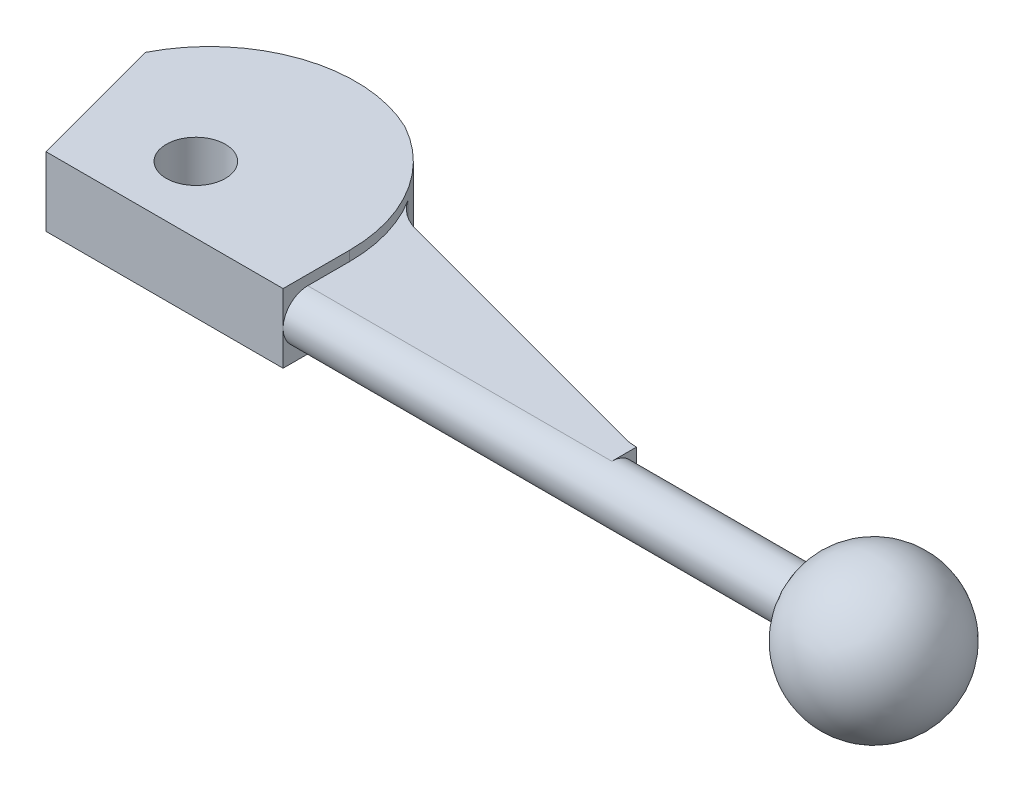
ISO-10303-21;
HEADER;
FILE_DESCRIPTION(('STEP AP214'),'2;1');
FILE_NAME('part.step','',(''),(''),'','','');
FILE_SCHEMA(('AUTOMOTIVE_DESIGN { 1 0 10303 214 1 1 1 1 }'));
ENDSEC;
DATA;
#1=APPLICATION_CONTEXT('core data for automotive mechanical design processes');
#2=APPLICATION_PROTOCOL_DEFINITION('international standard','automotive_design',2000,#1);
#3=PRODUCT_CONTEXT('',#1,'mechanical');
#4=PRODUCT('Part','Part','',(#3));
#5=PRODUCT_RELATED_PRODUCT_CATEGORY('part','',(#4));
#6=PRODUCT_DEFINITION_FORMATION('','',#4);
#7=PRODUCT_DEFINITION_CONTEXT('part definition',#1,'design');
#8=PRODUCT_DEFINITION('design','',#6,#7);
#9=PRODUCT_DEFINITION_SHAPE('','',#8);
#10=(LENGTH_UNIT() NAMED_UNIT(*) SI_UNIT(.MILLI.,.METRE.));
#11=(NAMED_UNIT(*) PLANE_ANGLE_UNIT() SI_UNIT($,.RADIAN.));
#12=(NAMED_UNIT(*) SI_UNIT($,.STERADIAN.) SOLID_ANGLE_UNIT());
#13=UNCERTAINTY_MEASURE_WITH_UNIT(LENGTH_MEASURE(1.E-05),#10,'distance_accuracy_value','');
#14=(GEOMETRIC_REPRESENTATION_CONTEXT(3) GLOBAL_UNCERTAINTY_ASSIGNED_CONTEXT((#13)) GLOBAL_UNIT_ASSIGNED_CONTEXT((#10,
#11,#12)) REPRESENTATION_CONTEXT('',''));
#15=CARTESIAN_POINT('',(0.,0.,0.));
#16=DIRECTION('',(0.,0.,1.));
#17=DIRECTION('',(1.,0.,0.));
#18=AXIS2_PLACEMENT_3D('',#15,#16,#17);
#19=CARTESIAN_POINT('',(0.,-7.,0.));
#20=DIRECTION('',(0.,-1.,0.));
#21=DIRECTION('',(1.,0.,0.));
#22=AXIS2_PLACEMENT_3D('',#19,#20,#21);
#23=CYLINDRICAL_SURFACE('',#22,6.);
#24=CARTESIAN_POINT('',(0.,7.,0.));
#25=DIRECTION('',(0.,-1.,0.));
#26=DIRECTION('',(1.,0.,0.));
#27=AXIS2_PLACEMENT_3D('',#24,#25,#26);
#28=CIRCLE('',#27,6.);
#29=CARTESIAN_POINT('',(6.,7.,0.));
#30=VERTEX_POINT('',#29);
#31=EDGE_CURVE('E222',#30,#30,#28,.F.);
#32=ORIENTED_EDGE('',*,*,#31,.T.);
#33=EDGE_LOOP('',(#32));
#34=FACE_BOUND('',#33,.T.);
#35=CARTESIAN_POINT('',(0.,-7.,0.));
#36=DIRECTION('',(0.,-1.,0.));
#37=DIRECTION('',(1.,0.,0.));
#38=AXIS2_PLACEMENT_3D('',#35,#36,#37);
#39=CIRCLE('',#38,6.);
#40=CARTESIAN_POINT('',(6.,-7.,0.));
#41=VERTEX_POINT('',#40);
#42=EDGE_CURVE('E17',#41,#41,#39,.F.);
#43=ORIENTED_EDGE('',*,*,#42,.F.);
#44=EDGE_LOOP('',(#43));
#45=FACE_BOUND('',#44,.T.);
#46=ADVANCED_FACE('F14',(#34,#45),#23,.F.);
#47=CARTESIAN_POINT('',(2.2,-7.,-0.550000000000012));
#48=DIRECTION('',(0.,-1.,0.));
#49=DIRECTION('',(1.,0.,0.));
#50=AXIS2_PLACEMENT_3D('',#47,#48,#49);
#51=CYLINDRICAL_SURFACE('',#50,29.7);
#52=CARTESIAN_POINT('',(2.2,-7.,-0.550000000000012));
#53=DIRECTION('',(0.,-1.,0.));
#54=DIRECTION('',(1.,0.,0.));
#55=AXIS2_PLACEMENT_3D('',#52,#53,#54);
#56=CIRCLE('',#55,29.7);
#57=CARTESIAN_POINT('',(-24.27,-7.,-14.0195619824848));
#58=VERTEX_POINT('',#57);
#59=CARTESIAN_POINT('',(15.105190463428,-7.,-27.2996926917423));
#60=VERTEX_POINT('',#59);
#61=EDGE_CURVE('E126',#58,#60,#56,.T.);
#62=ORIENTED_EDGE('',*,*,#61,.F.);
#63=DIRECTION('',(0.,-1.,0.));
#64=VECTOR('',#63,1.);
#65=CARTESIAN_POINT('',(-24.27,-7.,-14.0195619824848));
#66=LINE('',#65,#64);
#67=CARTESIAN_POINT('',(-24.27,7.,-14.0195619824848));
#68=VERTEX_POINT('',#67);
#69=EDGE_CURVE('E113',#58,#68,#66,.F.);
#70=ORIENTED_EDGE('',*,*,#69,.T.);
#71=CARTESIAN_POINT('',(2.2,7.,-0.550000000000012));
#72=DIRECTION('',(0.,-1.,0.));
#73=DIRECTION('',(1.,0.,0.));
#74=AXIS2_PLACEMENT_3D('',#71,#72,#73);
#75=CIRCLE('',#74,29.7);
#76=CARTESIAN_POINT('',(15.105190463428,7.,-27.2996926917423));
#77=VERTEX_POINT('',#76);
#78=EDGE_CURVE('E218',#68,#77,#75,.T.);
#79=ORIENTED_EDGE('',*,*,#78,.T.);
#80=DIRECTION('',(0.,-1.,0.));
#81=VECTOR('',#80,1.);
#82=CARTESIAN_POINT('',(15.1051904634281,-7.,-27.2996926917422));
#83=LINE('',#82,#81);
#84=EDGE_CURVE('E129',#60,#77,#83,.F.);
#85=ORIENTED_EDGE('',*,*,#84,.F.);
#86=EDGE_LOOP('',(#62,#70,#79,#85));
#87=FACE_BOUND('',#86,.T.);
#88=ADVANCED_FACE('F127',(#87),#51,.T.);
#89=CARTESIAN_POINT('',(-16.896155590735,-7.,13.5));
#90=DIRECTION('',(0.965925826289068,0.,-0.258819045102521));
#91=DIRECTION('',(0.258819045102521,0.,0.965925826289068));
#92=AXIS2_PLACEMENT_3D('',#89,#90,#91);
#93=PLANE('',#92);
#94=ORIENTED_EDGE('',*,*,#69,.F.);
#95=DIRECTION('',(-0.25881904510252,0.,-0.965925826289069));
#96=VECTOR('',#95,1.);
#97=CARTESIAN_POINT('',(-16.896155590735,-7.,13.5));
#98=LINE('',#97,#96);
#99=CARTESIAN_POINT('',(-16.896155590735,-7.,13.5));
#100=VERTEX_POINT('',#99);
#101=EDGE_CURVE('E117',#100,#58,#98,.T.);
#102=ORIENTED_EDGE('',*,*,#101,.F.);
#103=DIRECTION('',(0.,-1.,0.));
#104=VECTOR('',#103,1.);
#105=CARTESIAN_POINT('',(-16.896155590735,-7.,13.5));
#106=LINE('',#105,#104);
#107=CARTESIAN_POINT('',(-16.896155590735,7.,13.5));
#108=VERTEX_POINT('',#107);
#109=EDGE_CURVE('E144',#100,#108,#106,.F.);
#110=ORIENTED_EDGE('',*,*,#109,.T.);
#111=DIRECTION('',(-0.25881904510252,0.,-0.965925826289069));
#112=VECTOR('',#111,1.);
#113=CARTESIAN_POINT('',(-16.896155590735,7.,13.5));
#114=LINE('',#113,#112);
#115=EDGE_CURVE('E120',#108,#68,#114,.T.);
#116=ORIENTED_EDGE('',*,*,#115,.T.);
#117=EDGE_LOOP('',(#94,#102,#110,#116));
#118=FACE_BOUND('',#117,.T.);
#119=ADVANCED_FACE('F115',(#118),#93,.F.);
#120=CARTESIAN_POINT('',(2.2,-7.,-0.550000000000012));
#121=DIRECTION('',(0.,-1.,0.));
#122=DIRECTION('',(1.,0.,0.));
#123=AXIS2_PLACEMENT_3D('',#120,#121,#122);
#124=PLANE('',#123);
#125=DIRECTION('',(0.,0.,-1.));
#126=VECTOR('',#125,1.);
#127=CARTESIAN_POINT('',(31.2,-7.,0.));
#128=LINE('',#127,#126);
#129=CARTESIAN_POINT('',(31.2,-7.,0.));
#130=VERTEX_POINT('',#129);
#131=CARTESIAN_POINT('',(31.2,-7.,13.5));
#132=VERTEX_POINT('',#131);
#133=EDGE_CURVE('E142',#130,#132,#128,.F.);
#134=ORIENTED_EDGE('',*,*,#133,.T.);
#135=DIRECTION('',(1.,0.,0.));
#136=VECTOR('',#135,1.);
#137=CARTESIAN_POINT('',(31.2,-7.,13.5));
#138=LINE('',#137,#136);
#139=EDGE_CURVE('E136',#132,#100,#138,.F.);
#140=ORIENTED_EDGE('',*,*,#139,.T.);
#141=ORIENTED_EDGE('',*,*,#101,.T.);
#142=ORIENTED_EDGE('',*,*,#61,.T.);
#143=CARTESIAN_POINT('',(0.,-7.,0.));
#144=DIRECTION('',(0.,-1.,0.));
#145=DIRECTION('',(1.,0.,0.));
#146=AXIS2_PLACEMENT_3D('',#143,#144,#145);
#147=CIRCLE('',#146,31.2);
#148=EDGE_CURVE('E148',#130,#60,#147,.F.);
#149=ORIENTED_EDGE('',*,*,#148,.F.);
#150=EDGE_LOOP('',(#134,#140,#141,#142,#149));
#151=FACE_BOUND('',#150,.T.);
#152=ORIENTED_EDGE('',*,*,#42,.T.);
#153=EDGE_LOOP('',(#152));
#154=FACE_BOUND('',#153,.T.);
#155=ADVANCED_FACE('F133',(#151,#154),#124,.T.);
#156=CARTESIAN_POINT('',(92.816524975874,-5.,3.5));
#157=DIRECTION('',(0.,0.,1.));
#158=DIRECTION('',(0.,-1.,0.));
#159=AXIS2_PLACEMENT_3D('',#156,#157,#158);
#160=PLANE('',#159);
#161=DIRECTION('',(1.,0.,0.));
#162=VECTOR('',#161,1.);
#163=CARTESIAN_POINT('',(-1.14491749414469E-13,-5.,3.5));
#164=LINE('',#163,#162);
#165=CARTESIAN_POINT('',(92.816524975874,-5.,3.5));
#166=VERTEX_POINT('',#165);
#167=CARTESIAN_POINT('',(92.88,-5.,3.5));
#168=VERTEX_POINT('',#167);
#169=EDGE_CURVE('E207',#166,#168,#164,.T.);
#170=ORIENTED_EDGE('',*,*,#169,.F.);
#171=DIRECTION('',(0.,-1.,0.));
#172=VECTOR('',#171,1.);
#173=CARTESIAN_POINT('',(92.816524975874,-5.,3.5));
#174=LINE('',#173,#172);
#175=CARTESIAN_POINT('',(92.816524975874,5.,3.5));
#176=VERTEX_POINT('',#175);
#177=EDGE_CURVE('E219',#166,#176,#174,.F.);
#178=ORIENTED_EDGE('',*,*,#177,.T.);
#179=DIRECTION('',(1.,0.,0.));
#180=VECTOR('',#179,1.);
#181=CARTESIAN_POINT('',(92.816524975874,5.,3.5));
#182=LINE('',#181,#180);
#183=CARTESIAN_POINT('',(92.88,5.,3.5));
#184=VERTEX_POINT('',#183);
#185=EDGE_CURVE('E132',#184,#176,#182,.F.);
#186=ORIENTED_EDGE('',*,*,#185,.F.);
#187=DIRECTION('',(0.,1.,0.));
#188=VECTOR('',#187,1.);
#189=CARTESIAN_POINT('',(92.88,0.,3.5));
#190=LINE('',#189,#188);
#191=CARTESIAN_POINT('',(92.88,0.,3.5));
#192=VERTEX_POINT('',#191);
#193=EDGE_CURVE('E184',#192,#184,#190,.T.);
#194=ORIENTED_EDGE('',*,*,#193,.F.);
#195=DIRECTION('',(0.,1.,0.));
#196=VECTOR('',#195,1.);
#197=CARTESIAN_POINT('',(92.88,0.,3.5));
#198=LINE('',#197,#196);
#199=EDGE_CURVE('E191',#168,#192,#198,.T.);
#200=ORIENTED_EDGE('',*,*,#199,.F.);
#201=EDGE_LOOP('',(#170,#178,#186,#194,#200));
#202=FACE_BOUND('',#201,.T.);
#203=ADVANCED_FACE('F269',(#202),#160,.F.);
#204=CARTESIAN_POINT('',(34.8068652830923,-5.,-22.0436414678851));
#205=DIRECTION('',(0.,-1.,0.));
#206=DIRECTION('',(1.,0.,0.));
#207=AXIS2_PLACEMENT_3D('',#204,#205,#206);
#208=CYLINDRICAL_SURFACE('',#207,10.);
#209=DIRECTION('',(0.,-1.,0.));
#210=VECTOR('',#209,1.);
#211=CARTESIAN_POINT('',(32.2186748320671,-5.,-12.3843832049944));
#212=LINE('',#211,#210);
#213=CARTESIAN_POINT('',(32.2186748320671,5.,-12.3843832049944));
#214=VERTEX_POINT('',#213);
#215=CARTESIAN_POINT('',(32.2186748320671,-5.,-12.3843832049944));
#216=VERTEX_POINT('',#215);
#217=EDGE_CURVE('E225',#214,#216,#212,.T.);
#218=ORIENTED_EDGE('',*,*,#217,.T.);
#219=CARTESIAN_POINT('',(34.8068652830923,-5.,-22.0436414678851));
#220=DIRECTION('',(0.,-1.,0.));
#221=DIRECTION('',(1.,0.,0.));
#222=AXIS2_PLACEMENT_3D('',#219,#220,#221);
#223=CIRCLE('',#222,10.);
#224=CARTESIAN_POINT('',(26.3585970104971,-5.,-16.6932430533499));
#225=VERTEX_POINT('',#224);
#226=EDGE_CURVE('E202',#225,#216,#223,.F.);
#227=ORIENTED_EDGE('',*,*,#226,.F.);
#228=DIRECTION('',(0.,-1.,0.));
#229=VECTOR('',#228,1.);
#230=CARTESIAN_POINT('',(26.3585970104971,-7.,-16.6932430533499));
#231=LINE('',#230,#229);
#232=CARTESIAN_POINT('',(26.3585970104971,5.,-16.6932430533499));
#233=VERTEX_POINT('',#232);
#234=EDGE_CURVE('E217',#233,#225,#231,.T.);
#235=ORIENTED_EDGE('',*,*,#234,.F.);
#236=CARTESIAN_POINT('',(34.8068652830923,5.,-22.0436414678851));
#237=DIRECTION('',(0.,-1.,0.));
#238=DIRECTION('',(1.,0.,0.));
#239=AXIS2_PLACEMENT_3D('',#236,#237,#238);
#240=CIRCLE('',#239,10.);
#241=EDGE_CURVE('E180',#233,#214,#240,.F.);
#242=ORIENTED_EDGE('',*,*,#241,.T.);
#243=EDGE_LOOP('',(#218,#227,#235,#242));
#244=FACE_BOUND('',#243,.T.);
#245=ADVANCED_FACE('F265',(#244),#208,.F.);
#246=CARTESIAN_POINT('',(32.2186748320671,-5.,-12.3843832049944));
#247=DIRECTION('',(-0.258819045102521,0.,0.965925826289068));
#248=DIRECTION('',(-0.965925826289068,0.,-0.258819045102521));
#249=AXIS2_PLACEMENT_3D('',#246,#247,#248);
#250=PLANE('',#249);
#251=DIRECTION('',(0.,-1.,0.));
#252=VECTOR('',#251,1.);
#253=CARTESIAN_POINT('',(90.2283345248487,-5.,3.15925826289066));
#254=LINE('',#253,#252);
#255=CARTESIAN_POINT('',(90.2283345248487,5.,3.15925826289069));
#256=VERTEX_POINT('',#255);
#257=CARTESIAN_POINT('',(90.2283345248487,-5.,3.15925826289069));
#258=VERTEX_POINT('',#257);
#259=EDGE_CURVE('E223',#256,#258,#254,.T.);
#260=ORIENTED_EDGE('',*,*,#259,.T.);
#261=DIRECTION('',(0.965925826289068,0.,0.258819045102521));
#262=VECTOR('',#261,1.);
#263=CARTESIAN_POINT('',(32.2186748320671,-5.,-12.3843832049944));
#264=LINE('',#263,#262);
#265=EDGE_CURVE('E199',#216,#258,#264,.T.);
#266=ORIENTED_EDGE('',*,*,#265,.F.);
#267=ORIENTED_EDGE('',*,*,#217,.F.);
#268=DIRECTION('',(0.965925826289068,0.,0.258819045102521));
#269=VECTOR('',#268,1.);
#270=CARTESIAN_POINT('',(32.2186748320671,5.,-12.3843832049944));
#271=LINE('',#270,#269);
#272=EDGE_CURVE('E177',#214,#256,#271,.T.);
#273=ORIENTED_EDGE('',*,*,#272,.T.);
#274=EDGE_LOOP('',(#260,#266,#267,#273));
#275=FACE_BOUND('',#274,.T.);
#276=ADVANCED_FACE('F258',(#275),#250,.F.);
#277=CARTESIAN_POINT('',(92.816524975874,-5.,-6.5));
#278=DIRECTION('',(0.,-1.,0.));
#279=DIRECTION('',(1.,0.,0.));
#280=AXIS2_PLACEMENT_3D('',#277,#278,#279);
#281=CYLINDRICAL_SURFACE('',#280,10.);
#282=ORIENTED_EDGE('',*,*,#177,.F.);
#283=CARTESIAN_POINT('',(92.816524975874,-5.,-6.5));
#284=DIRECTION('',(0.,-1.,0.));
#285=DIRECTION('',(1.,0.,0.));
#286=AXIS2_PLACEMENT_3D('',#283,#284,#285);
#287=CIRCLE('',#286,10.);
#288=EDGE_CURVE('E194',#258,#166,#287,.F.);
#289=ORIENTED_EDGE('',*,*,#288,.F.);
#290=ORIENTED_EDGE('',*,*,#259,.F.);
#291=CARTESIAN_POINT('',(92.816524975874,5.,-6.5));
#292=DIRECTION('',(0.,-1.,0.));
#293=DIRECTION('',(1.,0.,0.));
#294=AXIS2_PLACEMENT_3D('',#291,#292,#293);
#295=CIRCLE('',#294,10.);
#296=EDGE_CURVE('E179',#256,#176,#295,.F.);
#297=ORIENTED_EDGE('',*,*,#296,.T.);
#298=EDGE_LOOP('',(#282,#289,#290,#297));
#299=FACE_BOUND('',#298,.T.);
#300=ADVANCED_FACE('F248',(#299),#281,.F.);
#301=CARTESIAN_POINT('',(2.2,7.,-0.550000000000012));
#302=DIRECTION('',(0.,-1.,0.));
#303=DIRECTION('',(1.,0.,0.));
#304=AXIS2_PLACEMENT_3D('',#301,#302,#303);
#305=PLANE('',#304);
#306=DIRECTION('',(1.,0.,0.));
#307=VECTOR('',#306,1.);
#308=CARTESIAN_POINT('',(31.2,7.,13.5));
#309=LINE('',#308,#307);
#310=CARTESIAN_POINT('',(31.2,7.,13.5));
#311=VERTEX_POINT('',#310);
#312=EDGE_CURVE('E146',#108,#311,#309,.T.);
#313=ORIENTED_EDGE('',*,*,#312,.T.);
#314=DIRECTION('',(0.,0.,-1.));
#315=VECTOR('',#314,1.);
#316=CARTESIAN_POINT('',(31.2,7.,0.));
#317=LINE('',#316,#315);
#318=CARTESIAN_POINT('',(31.2,7.,0.));
#319=VERTEX_POINT('',#318);
#320=EDGE_CURVE('E183',#311,#319,#317,.T.);
#321=ORIENTED_EDGE('',*,*,#320,.T.);
#322=CARTESIAN_POINT('',(0.,7.,0.));
#323=DIRECTION('',(0.,-1.,0.));
#324=DIRECTION('',(1.,0.,0.));
#325=AXIS2_PLACEMENT_3D('',#322,#323,#324);
#326=CIRCLE('',#325,31.2);
#327=EDGE_CURVE('E147',#77,#319,#326,.T.);
#328=ORIENTED_EDGE('',*,*,#327,.F.);
#329=ORIENTED_EDGE('',*,*,#78,.F.);
#330=ORIENTED_EDGE('',*,*,#115,.F.);
#331=EDGE_LOOP('',(#313,#321,#328,#329,#330));
#332=FACE_BOUND('',#331,.T.);
#333=ORIENTED_EDGE('',*,*,#31,.F.);
#334=EDGE_LOOP('',(#333));
#335=FACE_BOUND('',#334,.T.);
#336=ADVANCED_FACE('F245',(#332,#335),#305,.F.);
#337=CARTESIAN_POINT('',(0.,-7.,0.));
#338=DIRECTION('',(0.,-1.,0.));
#339=DIRECTION('',(1.,0.,0.));
#340=AXIS2_PLACEMENT_3D('',#337,#338,#339);
#341=CYLINDRICAL_SURFACE('',#340,31.2);
#342=DIRECTION('',(0.,-1.,0.));
#343=VECTOR('',#342,1.);
#344=CARTESIAN_POINT('',(31.2,-7.,0.));
#345=LINE('',#344,#343);
#346=CARTESIAN_POINT('',(31.2,5.,0.));
#347=VERTEX_POINT('',#346);
#348=EDGE_CURVE('E171',#319,#347,#345,.T.);
#349=ORIENTED_EDGE('',*,*,#348,.T.);
#350=CARTESIAN_POINT('',(0.,5.,0.));
#351=DIRECTION('',(0.,-1.,0.));
#352=DIRECTION('',(1.,0.,0.));
#353=AXIS2_PLACEMENT_3D('',#350,#351,#352);
#354=CIRCLE('',#353,31.2);
#355=EDGE_CURVE('E187',#347,#233,#354,.F.);
#356=ORIENTED_EDGE('',*,*,#355,.T.);
#357=ORIENTED_EDGE('',*,*,#234,.T.);
#358=CARTESIAN_POINT('',(0.,-5.,0.));
#359=DIRECTION('',(0.,-1.,0.));
#360=DIRECTION('',(1.,0.,0.));
#361=AXIS2_PLACEMENT_3D('',#358,#359,#360);
#362=CIRCLE('',#361,31.2);
#363=CARTESIAN_POINT('',(31.2,-5.,0.));
#364=VERTEX_POINT('',#363);
#365=EDGE_CURVE('E206',#364,#225,#362,.F.);
#366=ORIENTED_EDGE('',*,*,#365,.F.);
#367=DIRECTION('',(0.,-1.,0.));
#368=VECTOR('',#367,1.);
#369=CARTESIAN_POINT('',(31.2,-7.,0.));
#370=LINE('',#369,#368);
#371=EDGE_CURVE('E213',#364,#130,#370,.T.);
#372=ORIENTED_EDGE('',*,*,#371,.T.);
#373=ORIENTED_EDGE('',*,*,#148,.T.);
#374=ORIENTED_EDGE('',*,*,#84,.T.);
#375=ORIENTED_EDGE('',*,*,#327,.T.);
#376=EDGE_LOOP('',(#349,#356,#357,#366,#372,#373,#374,#375));
#377=FACE_BOUND('',#376,.T.);
#378=ADVANCED_FACE('F247',(#377),#341,.T.);
#379=CARTESIAN_POINT('',(31.2,-7.,13.5));
#380=DIRECTION('',(0.,0.,-1.));
#381=DIRECTION('',(1.,0.,0.));
#382=AXIS2_PLACEMENT_3D('',#379,#380,#381);
#383=PLANE('',#382);
#384=DIRECTION('',(0.,-1.,0.));
#385=VECTOR('',#384,1.);
#386=CARTESIAN_POINT('',(31.2,-7.,13.5));
#387=LINE('',#386,#385);
#388=CARTESIAN_POINT('',(31.2,0.,13.5));
#389=VERTEX_POINT('',#388);
#390=EDGE_CURVE('E165',#389,#311,#387,.F.);
#391=ORIENTED_EDGE('',*,*,#390,.T.);
#392=ORIENTED_EDGE('',*,*,#312,.F.);
#393=ORIENTED_EDGE('',*,*,#109,.F.);
#394=ORIENTED_EDGE('',*,*,#139,.F.);
#395=DIRECTION('',(0.,-1.,0.));
#396=VECTOR('',#395,1.);
#397=CARTESIAN_POINT('',(31.2,-7.,13.5));
#398=LINE('',#397,#396);
#399=EDGE_CURVE('E210',#132,#389,#398,.F.);
#400=ORIENTED_EDGE('',*,*,#399,.T.);
#401=EDGE_LOOP('',(#391,#392,#393,#394,#400));
#402=FACE_BOUND('',#401,.T.);
#403=ADVANCED_FACE('F256',(#402),#383,.F.);
#404=CARTESIAN_POINT('',(31.2,-7.,0.));
#405=DIRECTION('',(-1.,0.,0.));
#406=DIRECTION('',(0.,0.,-1.));
#407=AXIS2_PLACEMENT_3D('',#404,#405,#406);
#408=PLANE('',#407);
#409=ORIENTED_EDGE('',*,*,#133,.F.);
#410=ORIENTED_EDGE('',*,*,#371,.F.);
#411=DIRECTION('',(0.,0.,1.));
#412=VECTOR('',#411,1.);
#413=CARTESIAN_POINT('',(31.2,-5.,1.04083408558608E-13));
#414=LINE('',#413,#412);
#415=CARTESIAN_POINT('',(31.2,-5.,8.5));
#416=VERTEX_POINT('',#415);
#417=EDGE_CURVE('E203',#416,#364,#414,.F.);
#418=ORIENTED_EDGE('',*,*,#417,.F.);
#419=CARTESIAN_POINT('',(31.2,0.,8.5));
#420=DIRECTION('',(1.,0.,0.));
#421=DIRECTION('',(0.,1.,0.));
#422=AXIS2_PLACEMENT_3D('',#419,#420,#421);
#423=CIRCLE('',#422,5.);
#424=EDGE_CURVE('E168',#389,#416,#423,.T.);
#425=ORIENTED_EDGE('',*,*,#424,.F.);
#426=ORIENTED_EDGE('',*,*,#399,.F.);
#427=EDGE_LOOP('',(#409,#410,#418,#425,#426));
#428=FACE_BOUND('',#427,.T.);
#429=ADVANCED_FACE('F349',(#428),#408,.F.);
#430=CARTESIAN_POINT('',(-1.14491749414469E-13,-5.,1.04083408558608E-13));
#431=DIRECTION('',(0.,-1.,0.));
#432=DIRECTION('',(1.,0.,0.));
#433=AXIS2_PLACEMENT_3D('',#430,#431,#432);
#434=PLANE('',#433);
#435=ORIENTED_EDGE('',*,*,#265,.T.);
#436=ORIENTED_EDGE('',*,*,#288,.T.);
#437=ORIENTED_EDGE('',*,*,#169,.T.);
#438=DIRECTION('',(0.,0.,1.));
#439=VECTOR('',#438,1.);
#440=CARTESIAN_POINT('',(92.88,-5.,8.5));
#441=LINE('',#440,#439);
#442=CARTESIAN_POINT('',(92.88,-5.,8.5));
#443=VERTEX_POINT('',#442);
#444=EDGE_CURVE('E188',#443,#168,#441,.F.);
#445=ORIENTED_EDGE('',*,*,#444,.F.);
#446=DIRECTION('',(1.,0.,0.));
#447=VECTOR('',#446,1.);
#448=CARTESIAN_POINT('',(177.2,-5.,8.5));
#449=LINE('',#448,#447);
#450=EDGE_CURVE('E195',#416,#443,#449,.T.);
#451=ORIENTED_EDGE('',*,*,#450,.F.);
#452=ORIENTED_EDGE('',*,*,#417,.T.);
#453=ORIENTED_EDGE('',*,*,#365,.T.);
#454=ORIENTED_EDGE('',*,*,#226,.T.);
#455=EDGE_LOOP('',(#435,#436,#437,#445,#451,#452,#453,#454));
#456=FACE_BOUND('',#455,.T.);
#457=ADVANCED_FACE('F358',(#456),#434,.T.);
#458=CARTESIAN_POINT('',(92.88,0.,8.5));
#459=DIRECTION('',(1.,0.,0.));
#460=DIRECTION('',(0.,1.,0.));
#461=AXIS2_PLACEMENT_3D('',#458,#459,#460);
#462=PLANE('',#461);
#463=CARTESIAN_POINT('',(92.88,0.,8.5));
#464=DIRECTION('',(1.,0.,0.));
#465=DIRECTION('',(0.,1.,0.));
#466=AXIS2_PLACEMENT_3D('',#463,#464,#465);
#467=CIRCLE('',#466,5.);
#468=EDGE_CURVE('E198',#443,#192,#467,.T.);
#469=ORIENTED_EDGE('',*,*,#468,.F.);
#470=ORIENTED_EDGE('',*,*,#444,.T.);
#471=ORIENTED_EDGE('',*,*,#199,.T.);
#472=EDGE_LOOP('',(#469,#470,#471));
#473=FACE_BOUND('',#472,.T.);
#474=ADVANCED_FACE('F368',(#473),#462,.T.);
#475=CARTESIAN_POINT('',(92.88,0.,8.5));
#476=DIRECTION('',(1.,0.,0.));
#477=DIRECTION('',(0.,1.,0.));
#478=AXIS2_PLACEMENT_3D('',#475,#476,#477);
#479=PLANE('',#478);
#480=CARTESIAN_POINT('',(92.88,0.,8.5));
#481=DIRECTION('',(1.,0.,0.));
#482=DIRECTION('',(0.,1.,0.));
#483=AXIS2_PLACEMENT_3D('',#480,#481,#482);
#484=CIRCLE('',#483,5.);
#485=CARTESIAN_POINT('',(92.88,5.,8.5));
#486=VERTEX_POINT('',#485);
#487=EDGE_CURVE('E176',#192,#486,#484,.T.);
#488=ORIENTED_EDGE('',*,*,#487,.F.);
#489=ORIENTED_EDGE('',*,*,#193,.T.);
#490=DIRECTION('',(0.,0.,1.));
#491=VECTOR('',#490,1.);
#492=CARTESIAN_POINT('',(92.88,5.,1.04083408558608E-13));
#493=LINE('',#492,#491);
#494=EDGE_CURVE('E181',#184,#486,#493,.T.);
#495=ORIENTED_EDGE('',*,*,#494,.T.);
#496=EDGE_LOOP('',(#488,#489,#495));
#497=FACE_BOUND('',#496,.T.);
#498=ADVANCED_FACE('F378',(#497),#479,.T.);
#499=CARTESIAN_POINT('',(-1.14491749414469E-13,5.,1.04083408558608E-13));
#500=DIRECTION('',(0.,-1.,0.));
#501=DIRECTION('',(1.,0.,0.));
#502=AXIS2_PLACEMENT_3D('',#499,#500,#501);
#503=PLANE('',#502);
#504=ORIENTED_EDGE('',*,*,#185,.T.);
#505=ORIENTED_EDGE('',*,*,#296,.F.);
#506=ORIENTED_EDGE('',*,*,#272,.F.);
#507=ORIENTED_EDGE('',*,*,#241,.F.);
#508=ORIENTED_EDGE('',*,*,#355,.F.);
#509=DIRECTION('',(0.,0.,-1.));
#510=VECTOR('',#509,1.);
#511=CARTESIAN_POINT('',(31.2,5.,0.));
#512=LINE('',#511,#510);
#513=CARTESIAN_POINT('',(31.2,5.,8.5));
#514=VERTEX_POINT('',#513);
#515=EDGE_CURVE('E169',#347,#514,#512,.F.);
#516=ORIENTED_EDGE('',*,*,#515,.T.);
#517=DIRECTION('',(1.,0.,0.));
#518=VECTOR('',#517,1.);
#519=CARTESIAN_POINT('',(177.2,5.,8.5));
#520=LINE('',#519,#518);
#521=EDGE_CURVE('E172',#486,#514,#520,.F.);
#522=ORIENTED_EDGE('',*,*,#521,.F.);
#523=ORIENTED_EDGE('',*,*,#494,.F.);
#524=EDGE_LOOP('',(#504,#505,#506,#507,#508,#516,#522,#523));
#525=FACE_BOUND('',#524,.T.);
#526=ADVANCED_FACE('F388',(#525),#503,.F.);
#527=CARTESIAN_POINT('',(31.2,-7.,0.));
#528=DIRECTION('',(-1.,0.,0.));
#529=DIRECTION('',(0.,0.,-1.));
#530=AXIS2_PLACEMENT_3D('',#527,#528,#529);
#531=PLANE('',#530);
#532=CARTESIAN_POINT('',(31.2,0.,8.5));
#533=DIRECTION('',(1.,0.,0.));
#534=DIRECTION('',(0.,1.,0.));
#535=AXIS2_PLACEMENT_3D('',#532,#533,#534);
#536=CIRCLE('',#535,5.);
#537=EDGE_CURVE('E175',#514,#389,#536,.T.);
#538=ORIENTED_EDGE('',*,*,#537,.F.);
#539=ORIENTED_EDGE('',*,*,#515,.F.);
#540=ORIENTED_EDGE('',*,*,#348,.F.);
#541=ORIENTED_EDGE('',*,*,#320,.F.);
#542=ORIENTED_EDGE('',*,*,#390,.F.);
#543=EDGE_LOOP('',(#538,#539,#540,#541,#542));
#544=FACE_BOUND('',#543,.T.);
#545=ADVANCED_FACE('F398',(#544),#531,.F.);
#546=CARTESIAN_POINT('',(177.2,0.,8.5));
#547=DIRECTION('',(1.,0.,0.));
#548=DIRECTION('',(0.,1.,0.));
#549=AXIS2_PLACEMENT_3D('',#546,#547,#548);
#550=CYLINDRICAL_SURFACE('',#549,5.);
#551=CARTESIAN_POINT('',(133.,0.,8.5));
#552=DIRECTION('',(1.,0.,0.));
#553=DIRECTION('',(0.,1.,0.));
#554=AXIS2_PLACEMENT_3D('',#551,#552,#553);
#555=CIRCLE('',#554,5.);
#556=CARTESIAN_POINT('',(133.,5.,8.5));
#557=VERTEX_POINT('',#556);
#558=EDGE_CURVE('E23',#557,#557,#555,.F.);
#559=ORIENTED_EDGE('',*,*,#558,.T.);
#560=EDGE_LOOP('',(#559));
#561=FACE_BOUND('',#560,.T.);
#562=ORIENTED_EDGE('',*,*,#521,.T.);
#563=ORIENTED_EDGE('',*,*,#537,.T.);
#564=ORIENTED_EDGE('',*,*,#424,.T.);
#565=ORIENTED_EDGE('',*,*,#450,.T.);
#566=ORIENTED_EDGE('',*,*,#468,.T.);
#567=ORIENTED_EDGE('',*,*,#487,.T.);
#568=EDGE_LOOP('',(#562,#563,#564,#565,#566,#567));
#569=FACE_BOUND('',#568,.T.);
#570=ADVANCED_FACE('F408',(#561,#569),#550,.T.);
#571=CARTESIAN_POINT('',(133.,0.,1.01668522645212));
#572=DIRECTION('',(1.,0.,0.));
#573=DIRECTION('',(0.,1.,0.));
#574=AXIS2_PLACEMENT_3D('',#571,#572,#573);
#575=PLANE('',#574);
#576=CARTESIAN_POINT('',(133.,-7.4833147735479,8.5));
#577=CARTESIAN_POINT('',(133.,-7.48331628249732,8.2897537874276));
#578=CARTESIAN_POINT('',(133.,-7.47445072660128,8.07953233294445));
#579=CARTESIAN_POINT('',(133.,-7.43905038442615,7.66051345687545));
#580=CARTESIAN_POINT('',(133.,-7.41251094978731,7.45171642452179));
#581=CARTESIAN_POINT('',(133.,-7.34191342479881,7.03691713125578));
#582=CARTESIAN_POINT('',(133.,-7.29783973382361,6.83091752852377));
#583=CARTESIAN_POINT('',(133.,-7.19246872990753,6.42329008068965));
#584=CARTESIAN_POINT('',(133.,-7.13116512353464,6.22166386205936));
#585=CARTESIAN_POINT('',(133.,-6.99182402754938,5.82443086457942));
#586=CARTESIAN_POINT('',(133.,-6.91379774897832,5.62882015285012));
#587=CARTESIAN_POINT('',(133.,-6.74154067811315,5.2448650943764));
#588=CARTESIAN_POINT('',(133.,-6.64730964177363,5.05652085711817));
#589=CARTESIAN_POINT('',(133.,-6.44334135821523,4.68849076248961));
#590=CARTESIAN_POINT('',(133.,-6.33360827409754,4.50880259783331));
#591=CARTESIAN_POINT('',(133.,-6.09939404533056,4.15930366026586));
#592=CARTESIAN_POINT('',(133.,-5.97491255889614,3.9894931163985));
#593=CARTESIAN_POINT('',(133.,-5.71209889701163,3.6609741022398));
#594=CARTESIAN_POINT('',(133.,-5.57376782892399,3.50226474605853));
#595=CARTESIAN_POINT('',(133.,-5.28417954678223,3.19700815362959));
#596=CARTESIAN_POINT('',(133.,-5.13291787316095,3.05046514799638));
#597=CARTESIAN_POINT('',(133.,-4.81863549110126,2.77068939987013));
#598=CARTESIAN_POINT('',(133.,-4.65561854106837,2.637452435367));
#599=CARTESIAN_POINT('',(133.,-4.31887933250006,2.38513599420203));
#600=CARTESIAN_POINT('',(133.,-4.14515314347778,2.2660617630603));
#601=CARTESIAN_POINT('',(133.,-3.7883231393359,2.04299839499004));
#602=CARTESIAN_POINT('',(133.,-3.60522131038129,1.93900608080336));
#603=CARTESIAN_POINT('',(133.,-3.23090509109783,1.74681441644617));
#604=CARTESIAN_POINT('',(133.,-3.03969057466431,1.65861531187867));
#605=CARTESIAN_POINT('',(133.,-2.65051530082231,1.49864084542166));
#606=CARTESIAN_POINT('',(133.,-2.45255468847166,1.42686513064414));
#607=CARTESIAN_POINT('',(133.,-2.05128594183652,1.30024379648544));
#608=CARTESIAN_POINT('',(133.,-1.84797768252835,1.24539857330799));
#609=CARTESIAN_POINT('',(133.,-1.43750114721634,1.15303887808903));
#610=CARTESIAN_POINT('',(133.,-1.23033358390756,1.11552123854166));
#611=CARTESIAN_POINT('',(133.,-0.813502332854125,1.05805860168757));
#612=CARTESIAN_POINT('',(133.,-0.603837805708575,1.03811969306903));
#613=CARTESIAN_POINT('',(133.,-0.183649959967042,1.01598244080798));
#614=CARTESIAN_POINT('',(133.,0.0268730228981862,1.01377772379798));
#615=CARTESIAN_POINT('',(133.,0.447434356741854,1.0271102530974));
#616=CARTESIAN_POINT('',(133.,0.657472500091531,1.04265405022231));
#617=CARTESIAN_POINT('',(133.,1.0754520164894,1.09137902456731));
#618=CARTESIAN_POINT('',(133.,1.28339378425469,1.12455681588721));
#619=CARTESIAN_POINT('',(133.,1.69574644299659,1.20831246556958));
#620=CARTESIAN_POINT('',(133.,1.90015727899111,1.25889059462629));
#621=CARTESIAN_POINT('',(133.,2.30398773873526,1.37708612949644));
#622=CARTESIAN_POINT('',(133.,2.50340745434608,1.44470322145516));
#623=CARTESIAN_POINT('',(133.,2.89584648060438,1.59649822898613));
#624=CARTESIAN_POINT('',(133.,3.08886564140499,1.68067653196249));
#625=CARTESIAN_POINT('',(133.,3.46709129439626,1.86497737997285));
#626=CARTESIAN_POINT('',(133.,3.65229922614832,1.96509697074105));
#627=CARTESIAN_POINT('',(133.,4.01368674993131,2.1806174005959));
#628=CARTESIAN_POINT('',(133.,4.18986319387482,2.29602351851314));
#629=CARTESIAN_POINT('',(133.,4.53180453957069,2.54122547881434));
#630=CARTESIAN_POINT('',(133.,4.69757314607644,2.67101615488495));
#631=CARTESIAN_POINT('',(133.,5.01764862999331,2.94414893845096));
#632=CARTESIAN_POINT('',(133.,5.17195125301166,3.08749603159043));
#633=CARTESIAN_POINT('',(133.,5.46790120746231,3.38665295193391));
#634=CARTESIAN_POINT('',(133.,5.60955096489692,3.54246037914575));
#635=CARTESIAN_POINT('',(133.,5.87922357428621,3.86545644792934));
#636=CARTESIAN_POINT('',(133.,6.0072462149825,4.03264526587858));
#637=CARTESIAN_POINT('',(133.,6.24874967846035,4.37721127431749));
#638=CARTESIAN_POINT('',(133.,6.36223078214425,4.55458826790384));
#639=CARTESIAN_POINT('',(133.,6.57384928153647,4.9182719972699));
#640=CARTESIAN_POINT('',(133.,6.67198631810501,5.10457894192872));
#641=CARTESIAN_POINT('',(133.,6.85220079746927,5.4847765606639));
#642=CARTESIAN_POINT('',(133.,6.93428124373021,5.67866580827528));
#643=CARTESIAN_POINT('',(133.,7.0818408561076,6.07268471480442));
#644=CARTESIAN_POINT('',(133.,7.14731418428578,6.27281654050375));
#645=CARTESIAN_POINT('',(133.,7.31799635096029,6.88028642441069));
#646=CARTESIAN_POINT('',(133.,7.39766124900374,7.29510897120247));
#647=CARTESIAN_POINT('',(133.,7.48611442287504,8.13224302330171));
#648=CARTESIAN_POINT('',(133.,7.4949026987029,8.55455452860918));
#649=CARTESIAN_POINT('',(133.,7.45494505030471,9.1842810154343));
#650=CARTESIAN_POINT('',(133.,7.43274318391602,9.39367676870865));
#651=CARTESIAN_POINT('',(133.,7.3707882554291,9.80983337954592));
#652=CARTESIAN_POINT('',(133.,7.33104135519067,10.016595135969));
#653=CARTESIAN_POINT('',(133.,7.23426413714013,10.4260602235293));
#654=CARTESIAN_POINT('',(133.,7.17723058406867,10.6287627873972));
#655=CARTESIAN_POINT('',(133.,7.04629157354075,11.0286417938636));
#656=CARTESIAN_POINT('',(133.,6.97238651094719,11.225818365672));
#657=CARTESIAN_POINT('',(133.,6.80822704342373,11.6132474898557));
#658=CARTESIAN_POINT('',(133.,6.71797232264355,11.8034999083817));
#659=CARTESIAN_POINT('',(133.,6.52175783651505,12.1757224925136));
#660=CARTESIAN_POINT('',(133.,6.41579831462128,12.3576927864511));
#661=CARTESIAN_POINT('',(133.,6.18890459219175,12.7120943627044));
#662=CARTESIAN_POINT('',(133.,6.06796751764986,12.8845238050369));
#663=CARTESIAN_POINT('',(133.,5.81204221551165,13.2185179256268));
#664=CARTESIAN_POINT('',(133.,5.6770591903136,13.3800865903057));
#665=CARTESIAN_POINT('',(133.,5.39391359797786,13.6913364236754));
#666=CARTESIAN_POINT('',(133.,5.24574632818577,13.8410133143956));
#667=CARTESIAN_POINT('',(133.,4.93738081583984,14.127301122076));
#668=CARTESIAN_POINT('',(133.,4.77718675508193,14.2639165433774));
#669=CARTESIAN_POINT('',(133.,4.44583034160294,14.5231931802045));
#670=CARTESIAN_POINT('',(133.,4.27466596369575,14.6458518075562));
#671=CARTESIAN_POINT('',(133.,3.92261662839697,14.8763108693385));
#672=CARTESIAN_POINT('',(133.,3.74173189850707,14.9841116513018));
#673=CARTESIAN_POINT('',(133.,3.37152070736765,15.1840938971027));
#674=CARTESIAN_POINT('',(133.,3.18219409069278,15.2762750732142));
#675=CARTESIAN_POINT('',(133.,2.79645128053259,15.4443590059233));
#676=CARTESIAN_POINT('',(133.,2.60003519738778,15.5202620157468));
#677=CARTESIAN_POINT('',(133.,2.2014687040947,15.6552647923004));
#678=CARTESIAN_POINT('',(133.,1.99931720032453,15.714361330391));
#679=CARTESIAN_POINT('',(133.,1.59082921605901,15.8152927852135));
#680=CARTESIAN_POINT('',(133.,1.38449430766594,15.857134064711));
#681=CARTESIAN_POINT('',(133.,0.96895871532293,15.9233009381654));
#682=CARTESIAN_POINT('',(133.,0.759757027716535,15.947620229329));
#683=CARTESIAN_POINT('',(133.,0.34012123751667,15.9785402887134));
#684=CARTESIAN_POINT('',(133.,0.129687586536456,15.9851471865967));
#685=CARTESIAN_POINT('',(133.,-0.291026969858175,15.9806127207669));
#686=CARTESIAN_POINT('',(133.,-0.501307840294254,15.9694681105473));
#687=CARTESIAN_POINT('',(133.,-0.920178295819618,15.9295042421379));
#688=CARTESIAN_POINT('',(133.,-1.12876792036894,15.9006853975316));
#689=CARTESIAN_POINT('',(133.,-1.54278244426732,15.8255774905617));
#690=CARTESIAN_POINT('',(133.,-1.74820727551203,15.779288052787));
#691=CARTESIAN_POINT('',(133.,-2.15442395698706,15.6695689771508));
#692=CARTESIAN_POINT('',(133.,-2.35521587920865,15.6061396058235));
#693=CARTESIAN_POINT('',(133.,-2.75078437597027,15.4625760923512));
#694=CARTESIAN_POINT('',(133.,-2.94555967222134,15.3824384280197));
#695=CARTESIAN_POINT('',(133.,-3.32759464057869,15.2060690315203));
#696=CARTESIAN_POINT('',(133.,-3.51485706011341,15.1098432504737));
#697=CARTESIAN_POINT('',(133.,-3.88066983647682,14.9019276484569));
#698=CARTESIAN_POINT('',(133.,-4.05921740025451,14.7902329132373));
#699=CARTESIAN_POINT('',(133.,-4.40620663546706,14.5522383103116));
#700=CARTESIAN_POINT('',(133.,-4.57465178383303,14.4259435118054));
#701=CARTESIAN_POINT('',(133.,-4.90031927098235,14.1596045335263));
#702=CARTESIAN_POINT('',(133.,-5.05754071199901,14.0195592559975));
#703=CARTESIAN_POINT('',(133.,-5.359624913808,13.7267266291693));
#704=CARTESIAN_POINT('',(133.,-5.50448796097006,13.5739395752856));
#705=CARTESIAN_POINT('',(133.,-5.78086695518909,13.2566638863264));
#706=CARTESIAN_POINT('',(133.,-5.9123793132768,13.0921721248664));
#707=CARTESIAN_POINT('',(133.,-6.16107551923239,12.7526957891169));
#708=CARTESIAN_POINT('',(133.,-6.278259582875,12.5777113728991));
#709=CARTESIAN_POINT('',(133.,-6.49754163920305,12.2183711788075));
#710=CARTESIAN_POINT('',(133.,-6.5996294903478,12.0340092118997));
#711=CARTESIAN_POINT('',(133.,-6.78786393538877,11.6574046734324));
#712=CARTESIAN_POINT('',(133.,-6.87401634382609,11.4651650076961));
#713=CARTESIAN_POINT('',(133.,-7.02974403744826,11.0742796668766));
#714=CARTESIAN_POINT('',(133.,-7.09933402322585,10.8756398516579));
#715=CARTESIAN_POINT('',(133.,-7.22152362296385,10.4732722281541));
#716=CARTESIAN_POINT('',(133.,-7.27412770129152,10.2695457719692));
#717=CARTESIAN_POINT('',(133.,-7.37293786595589,9.80717268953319));
#718=CARTESIAN_POINT('',(133.,-7.41429408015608,9.54747542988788));
#719=CARTESIAN_POINT('',(133.,-7.46948159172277,9.02517257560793));
#720=CARTESIAN_POINT('',(133.,-7.48331288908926,8.76256698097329));
#721=CARTESIAN_POINT('',(133.,-7.4833147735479,8.5));
#722=B_SPLINE_CURVE_WITH_KNOTS('',3,(#576,#577,#578,#579,#580,#581,#582,#583,#584,#585,#586,
#587,#588,#589,#590,#591,#592,#593,#594,#595,#596,#597,#598,#599,#600,#601,#602,#603,#604,#605,
#606,#607,#608,#609,#610,#611,#612,#613,#614,#615,#616,#617,#618,#619,#620,#621,#622,#623,#624,
#625,#626,#627,#628,#629,#630,#631,#632,#633,#634,#635,#636,#637,#638,#639,#640,#641,#642,#643,
#644,#645,#646,#647,#648,#649,#650,#651,#652,#653,#654,#655,#656,#657,#658,#659,#660,#661,#662,
#663,#664,#665,#666,#667,#668,#669,#670,#671,#672,#673,#674,#675,#676,#677,#678,#679,#680,#681,
#682,#683,#684,#685,#686,#687,#688,#689,#690,#691,#692,#693,#694,#695,#696,#697,#698,#699,#700,
#701,#702,#703,#704,#705,#706,#707,#708,#709,#710,#711,#712,#713,#714,#715,#716,#717,#718,#719,
#720,#721),.UNSPECIFIED.,.T.,.F.,(4,2,2,2,2,2,2,2,2,2,2,2,2,2,2,2,2,2,2,2,2,2,2,2,2,2,2,2,2,2,2,
2,2,2,2,2,2,2,2,2,2,2,2,2,2,2,2,2,2,2,2,2,2,2,2,2,2,2,2,2,2,2,2,2,2,2,2,2,2,2,2,2,4),(0.,
0.630509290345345,1.26118447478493,1.89242204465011,2.52389048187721,3.15493689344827,
3.78599280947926,4.41687957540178,5.04778096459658,5.67863194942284,6.30970138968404,
6.94056995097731,7.57167144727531,8.20263979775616,8.83361795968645,9.46458256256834,
10.0955619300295,10.7264259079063,11.3575083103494,11.9883639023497,12.6194524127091,
13.2504197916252,13.8813969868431,14.512362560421,15.1433428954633,15.7742064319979,
16.4052883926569,17.0361444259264,17.6672333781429,18.2982010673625,18.9291785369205,
19.560143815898,20.1911238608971,20.8219857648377,21.453069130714,22.7138923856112,
23.9747156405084,24.6057990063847,25.2366609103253,25.8676409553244,26.4986062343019,
27.1295837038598,27.7605513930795,28.391640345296,29.0224963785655,29.6535783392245,
30.2844418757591,30.9154222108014,31.5463877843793,32.1773649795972,32.8083323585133,
33.4394208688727,34.070276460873,34.7013588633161,35.3322228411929,35.9632022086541,
36.5941668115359,37.2251449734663,37.8561133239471,38.4872148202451,39.1180833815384,
39.7491528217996,40.3800038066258,41.0109051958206,41.6417919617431,42.2728478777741,
42.9038942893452,43.5353627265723,44.1666002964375,44.7972754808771,45.4277847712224,
46.2151992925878,47.0026138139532),.UNSPECIFIED.);
#723=CARTESIAN_POINT('',(133.,-7.4833147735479,8.5));
#724=VERTEX_POINT('',#723);
#725=EDGE_CURVE('E9',#724,#724,#722,.T.);
#726=ORIENTED_EDGE('',*,*,#725,.F.);
#727=EDGE_LOOP('',(#726));
#728=FACE_BOUND('',#727,.T.);
#729=ORIENTED_EDGE('',*,*,#558,.F.);
#730=EDGE_LOOP('',(#729));
#731=FACE_BOUND('',#730,.T.);
#732=ADVANCED_FACE('F156',(#728,#731),#575,.F.);
#733=CARTESIAN_POINT('',(146.,0.,8.5));
#734=DIRECTION('',(0.,0.,-1.));
#735=DIRECTION('',(0.,-1.,0.));
#736=AXIS2_PLACEMENT_3D('',#733,#734,#735);
#737=SPHERICAL_SURFACE('',#736,15.);
#738=CARTESIAN_POINT('',(146.,0.,23.5));
#739=VERTEX_POINT('',#738);
#740=VERTEX_LOOP('',#739);
#741=FACE_BOUND('',#740,.T.);
#742=CARTESIAN_POINT('',(146.,0.,-6.5));
#743=VERTEX_POINT('',#742);
#744=VERTEX_LOOP('',#743);
#745=FACE_BOUND('',#744,.T.);
#746=ORIENTED_EDGE('',*,*,#725,.T.);
#747=EDGE_LOOP('',(#746));
#748=FACE_BOUND('',#747,.T.);
#749=ADVANCED_FACE('F159',(#741,#745,#748),#737,.T.);
#750=CLOSED_SHELL('',(#46,#88,#119,#155,#203,#245,#276,#300,#336,#378,#403,#429,#457,#474,#498,
#526,#545,#570,#732,#749));
#751=MANIFOLD_SOLID_BREP('B1',#750);
#752=ADVANCED_BREP_SHAPE_REPRESENTATION('',(#18,#751),#14);
#753=SHAPE_DEFINITION_REPRESENTATION(#9,#752);
ENDSEC;
END-ISO-10303-21;
